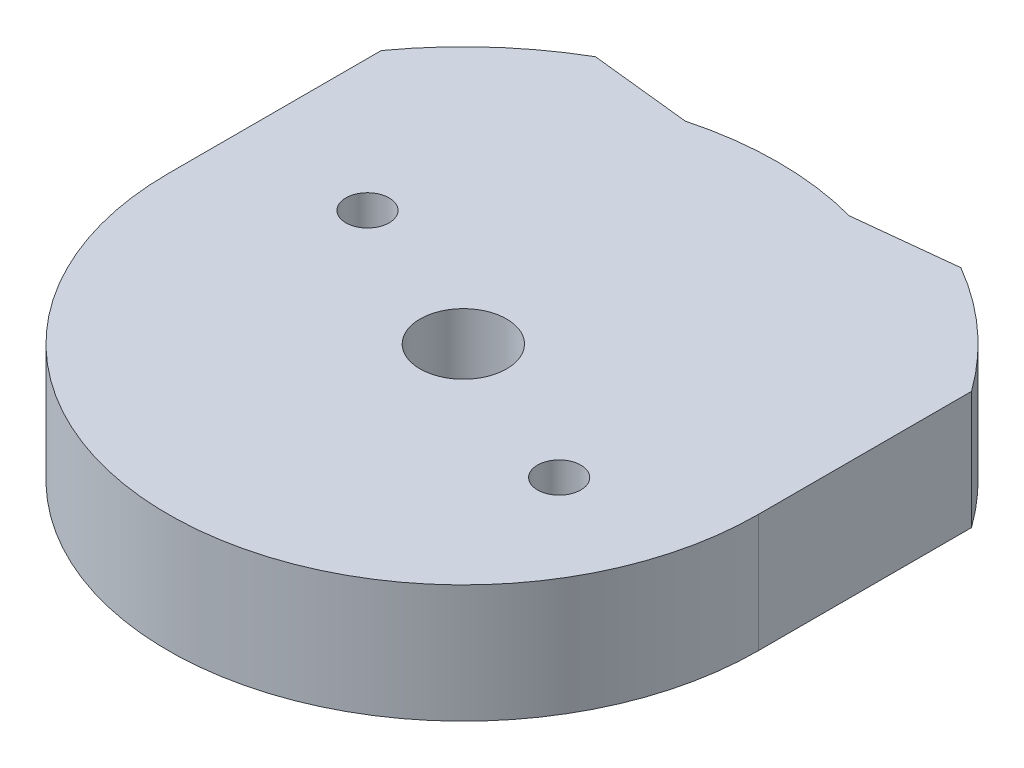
ISO-10303-21;
HEADER;
FILE_DESCRIPTION(('STEP AP214'),'2;1');
FILE_NAME('part.step','',(''),(''),'','','');
FILE_SCHEMA(('AUTOMOTIVE_DESIGN { 1 0 10303 214 1 1 1 1 }'));
ENDSEC;
DATA;
#1=APPLICATION_CONTEXT('core data for automotive mechanical design processes');
#2=APPLICATION_PROTOCOL_DEFINITION('international standard','automotive_design',2000,#1);
#3=PRODUCT_CONTEXT('',#1,'mechanical');
#4=PRODUCT('Part','Part','',(#3));
#5=PRODUCT_RELATED_PRODUCT_CATEGORY('part','',(#4));
#6=PRODUCT_DEFINITION_FORMATION('','',#4);
#7=PRODUCT_DEFINITION_CONTEXT('part definition',#1,'design');
#8=PRODUCT_DEFINITION('design','',#6,#7);
#9=PRODUCT_DEFINITION_SHAPE('','',#8);
#10=(LENGTH_UNIT() NAMED_UNIT(*) SI_UNIT(.MILLI.,.METRE.));
#11=(NAMED_UNIT(*) PLANE_ANGLE_UNIT() SI_UNIT($,.RADIAN.));
#12=(NAMED_UNIT(*) SI_UNIT($,.STERADIAN.) SOLID_ANGLE_UNIT());
#13=UNCERTAINTY_MEASURE_WITH_UNIT(LENGTH_MEASURE(1.E-05),#10,'distance_accuracy_value','');
#14=(GEOMETRIC_REPRESENTATION_CONTEXT(3) GLOBAL_UNCERTAINTY_ASSIGNED_CONTEXT((#13)) GLOBAL_UNIT_ASSIGNED_CONTEXT((#10,
#11,#12)) REPRESENTATION_CONTEXT('',''));
#15=CARTESIAN_POINT('',(0.,0.,0.));
#16=DIRECTION('',(0.,0.,1.));
#17=DIRECTION('',(1.,0.,0.));
#18=AXIS2_PLACEMENT_3D('',#15,#16,#17);
#19=CARTESIAN_POINT('',(0.,6.,0.));
#20=DIRECTION('',(0.,1.,0.));
#21=DIRECTION('',(0.,0.,1.));
#22=AXIS2_PLACEMENT_3D('',#19,#20,#21);
#23=PLANE('',#22);
#24=CARTESIAN_POINT('',(8.31491579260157,6.,3.44415089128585));
#25=DIRECTION('',(0.,1.,0.));
#26=DIRECTION('',(0.,0.,1.));
#27=AXIS2_PLACEMENT_3D('',#24,#25,#26);
#28=CIRCLE('',#27,1.1);
#29=CARTESIAN_POINT('',(8.31491579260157,6.,4.54415089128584));
#30=VERTEX_POINT('',#29);
#31=EDGE_CURVE('E166',#30,#30,#28,.T.);
#32=ORIENTED_EDGE('',*,*,#31,.F.);
#33=EDGE_LOOP('',(#32));
#34=FACE_BOUND('',#33,.T.);
#35=CARTESIAN_POINT('',(0.,6.,0.));
#36=DIRECTION('',(0.,1.,0.));
#37=DIRECTION('',(0.,0.,1.));
#38=AXIS2_PLACEMENT_3D('',#35,#36,#37);
#39=CIRCLE('',#38,15.);
#40=CARTESIAN_POINT('',(-15.,6.,0.));
#41=VERTEX_POINT('',#40);
#42=CARTESIAN_POINT('',(15.,6.,0.));
#43=VERTEX_POINT('',#42);
#44=EDGE_CURVE('E129',#41,#43,#39,.T.);
#45=ORIENTED_EDGE('',*,*,#44,.T.);
#46=DIRECTION('',(0.,0.,-1.));
#47=VECTOR('',#46,1.);
#48=CARTESIAN_POINT('',(15.,6.,0.));
#49=LINE('',#48,#47);
#50=CARTESIAN_POINT('',(15.,6.,-10.8282039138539));
#51=VERTEX_POINT('',#50);
#52=EDGE_CURVE('E77',#43,#51,#49,.T.);
#53=ORIENTED_EDGE('',*,*,#52,.T.);
#54=CARTESIAN_POINT('',(0.,6.,0.));
#55=DIRECTION('',(0.,1.,0.));
#56=DIRECTION('',(0.,0.,1.));
#57=AXIS2_PLACEMENT_3D('',#54,#55,#56);
#58=CIRCLE('',#57,18.5);
#59=CARTESIAN_POINT('',(9.28708781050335,6.,-16.));
#60=VERTEX_POINT('',#59);
#61=EDGE_CURVE('E144',#51,#60,#58,.T.);
#62=ORIENTED_EDGE('',*,*,#61,.T.);
#63=DIRECTION('',(-0.994252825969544,0.,0.107057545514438));
#64=VECTOR('',#63,1.);
#65=CARTESIAN_POINT('',(4.16478415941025,6.,-15.448448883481));
#66=LINE('',#65,#64);
#67=CARTESIAN_POINT('',(4.16478415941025,6.,-15.448448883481));
#68=VERTEX_POINT('',#67);
#69=EDGE_CURVE('E157',#60,#68,#66,.T.);
#70=ORIENTED_EDGE('',*,*,#69,.T.);
#71=CARTESIAN_POINT('',(0.,6.,0.));
#72=DIRECTION('',(0.,1.,0.));
#73=DIRECTION('',(0.,0.,1.));
#74=AXIS2_PLACEMENT_3D('',#71,#72,#73);
#75=CIRCLE('',#74,16.);
#76=CARTESIAN_POINT('',(-4.16478415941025,6.,-15.448448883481));
#77=VERTEX_POINT('',#76);
#78=EDGE_CURVE('E96',#68,#77,#75,.T.);
#79=ORIENTED_EDGE('',*,*,#78,.T.);
#80=DIRECTION('',(-0.994252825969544,0.,-0.107057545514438));
#81=VECTOR('',#80,1.);
#82=CARTESIAN_POINT('',(-9.28708781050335,6.,-16.));
#83=LINE('',#82,#81);
#84=CARTESIAN_POINT('',(-9.28708781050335,6.,-16.));
#85=VERTEX_POINT('',#84);
#86=EDGE_CURVE('E90',#77,#85,#83,.T.);
#87=ORIENTED_EDGE('',*,*,#86,.T.);
#88=CARTESIAN_POINT('',(0.,6.,0.));
#89=DIRECTION('',(0.,1.,0.));
#90=DIRECTION('',(0.,0.,1.));
#91=AXIS2_PLACEMENT_3D('',#88,#89,#90);
#92=CIRCLE('',#91,18.5);
#93=CARTESIAN_POINT('',(-15.,6.,-10.8282039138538));
#94=VERTEX_POINT('',#93);
#95=EDGE_CURVE('E94',#85,#94,#92,.T.);
#96=ORIENTED_EDGE('',*,*,#95,.T.);
#97=DIRECTION('',(0.,0.,1.));
#98=VECTOR('',#97,1.);
#99=CARTESIAN_POINT('',(-15.,6.,0.));
#100=LINE('',#99,#98);
#101=EDGE_CURVE('E34',#94,#41,#100,.T.);
#102=ORIENTED_EDGE('',*,*,#101,.T.);
#103=EDGE_LOOP('',(#45,#53,#62,#70,#79,#87,#96,#102));
#104=FACE_BOUND('',#103,.T.);
#105=CARTESIAN_POINT('',(0.,6.,0.));
#106=DIRECTION('',(0.,1.,0.));
#107=DIRECTION('',(0.,0.,1.));
#108=AXIS2_PLACEMENT_3D('',#105,#106,#107);
#109=CIRCLE('',#108,2.2);
#110=CARTESIAN_POINT('',(0.,6.,2.2));
#111=VERTEX_POINT('',#110);
#112=EDGE_CURVE('E118',#111,#111,#109,.T.);
#113=ORIENTED_EDGE('',*,*,#112,.F.);
#114=EDGE_LOOP('',(#113));
#115=FACE_BOUND('',#114,.T.);
#116=CARTESIAN_POINT('',(-8.31491579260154,6.,-3.4441508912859));
#117=DIRECTION('',(0.,1.,0.));
#118=DIRECTION('',(0.,0.,1.));
#119=AXIS2_PLACEMENT_3D('',#116,#117,#118);
#120=CIRCLE('',#119,1.1);
#121=CARTESIAN_POINT('',(-8.31491579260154,6.,-2.3441508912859));
#122=VERTEX_POINT('',#121);
#123=EDGE_CURVE('E172',#122,#122,#120,.T.);
#124=ORIENTED_EDGE('',*,*,#123,.F.);
#125=EDGE_LOOP('',(#124));
#126=FACE_BOUND('',#125,.T.);
#127=ADVANCED_FACE('F17',(#34,#104,#115,#126),#23,.T.);
#128=CARTESIAN_POINT('',(0.,0.,0.));
#129=DIRECTION('',(0.,1.,0.));
#130=DIRECTION('',(0.,0.,1.));
#131=AXIS2_PLACEMENT_3D('',#128,#129,#130);
#132=PLANE('',#131);
#133=CARTESIAN_POINT('',(8.31491579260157,0.,3.44415089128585));
#134=DIRECTION('',(0.,1.,0.));
#135=DIRECTION('',(0.,0.,1.));
#136=AXIS2_PLACEMENT_3D('',#133,#134,#135);
#137=CIRCLE('',#136,1.1);
#138=CARTESIAN_POINT('',(8.31491579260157,0.,4.54415089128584));
#139=VERTEX_POINT('',#138);
#140=EDGE_CURVE('E169',#139,#139,#137,.T.);
#141=ORIENTED_EDGE('',*,*,#140,.T.);
#142=EDGE_LOOP('',(#141));
#143=FACE_BOUND('',#142,.T.);
#144=CARTESIAN_POINT('',(0.,0.,0.));
#145=DIRECTION('',(0.,1.,0.));
#146=DIRECTION('',(0.,0.,1.));
#147=AXIS2_PLACEMENT_3D('',#144,#145,#146);
#148=CIRCLE('',#147,15.);
#149=CARTESIAN_POINT('',(-15.,0.,0.));
#150=VERTEX_POINT('',#149);
#151=CARTESIAN_POINT('',(15.,0.,0.));
#152=VERTEX_POINT('',#151);
#153=EDGE_CURVE('E114',#150,#152,#148,.T.);
#154=ORIENTED_EDGE('',*,*,#153,.F.);
#155=DIRECTION('',(0.,0.,1.));
#156=VECTOR('',#155,1.);
#157=CARTESIAN_POINT('',(-15.,0.,0.));
#158=LINE('',#157,#156);
#159=CARTESIAN_POINT('',(-15.,0.,-10.8282039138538));
#160=VERTEX_POINT('',#159);
#161=EDGE_CURVE('E69',#160,#150,#158,.T.);
#162=ORIENTED_EDGE('',*,*,#161,.F.);
#163=CARTESIAN_POINT('',(0.,0.,0.));
#164=DIRECTION('',(0.,1.,0.));
#165=DIRECTION('',(0.,0.,1.));
#166=AXIS2_PLACEMENT_3D('',#163,#164,#165);
#167=CIRCLE('',#166,18.5);
#168=CARTESIAN_POINT('',(-9.28708781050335,0.,-16.));
#169=VERTEX_POINT('',#168);
#170=EDGE_CURVE('E63',#169,#160,#167,.T.);
#171=ORIENTED_EDGE('',*,*,#170,.F.);
#172=DIRECTION('',(-0.994252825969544,0.,-0.107057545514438));
#173=VECTOR('',#172,1.);
#174=CARTESIAN_POINT('',(-9.28708781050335,0.,-16.));
#175=LINE('',#174,#173);
#176=CARTESIAN_POINT('',(-4.16478415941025,0.,-15.448448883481));
#177=VERTEX_POINT('',#176);
#178=EDGE_CURVE('E104',#177,#169,#175,.T.);
#179=ORIENTED_EDGE('',*,*,#178,.F.);
#180=CARTESIAN_POINT('',(0.,0.,0.));
#181=DIRECTION('',(0.,1.,0.));
#182=DIRECTION('',(0.,0.,1.));
#183=AXIS2_PLACEMENT_3D('',#180,#181,#182);
#184=CIRCLE('',#183,16.);
#185=CARTESIAN_POINT('',(4.16478415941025,0.,-15.448448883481));
#186=VERTEX_POINT('',#185);
#187=EDGE_CURVE('E124',#186,#177,#184,.T.);
#188=ORIENTED_EDGE('',*,*,#187,.F.);
#189=DIRECTION('',(-0.994252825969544,0.,0.107057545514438));
#190=VECTOR('',#189,1.);
#191=CARTESIAN_POINT('',(4.16478415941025,0.,-15.448448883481));
#192=LINE('',#191,#190);
#193=CARTESIAN_POINT('',(9.28708781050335,0.,-16.));
#194=VERTEX_POINT('',#193);
#195=EDGE_CURVE('E122',#194,#186,#192,.T.);
#196=ORIENTED_EDGE('',*,*,#195,.F.);
#197=CARTESIAN_POINT('',(0.,0.,0.));
#198=DIRECTION('',(0.,1.,0.));
#199=DIRECTION('',(0.,0.,1.));
#200=AXIS2_PLACEMENT_3D('',#197,#198,#199);
#201=CIRCLE('',#200,18.5);
#202=CARTESIAN_POINT('',(15.,0.,-10.8282039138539));
#203=VERTEX_POINT('',#202);
#204=EDGE_CURVE('E120',#203,#194,#201,.T.);
#205=ORIENTED_EDGE('',*,*,#204,.F.);
#206=DIRECTION('',(0.,0.,-1.));
#207=VECTOR('',#206,1.);
#208=CARTESIAN_POINT('',(15.,0.,0.));
#209=LINE('',#208,#207);
#210=EDGE_CURVE('E117',#152,#203,#209,.T.);
#211=ORIENTED_EDGE('',*,*,#210,.F.);
#212=EDGE_LOOP('',(#154,#162,#171,#179,#188,#196,#205,#211));
#213=FACE_BOUND('',#212,.T.);
#214=CARTESIAN_POINT('',(0.,0.,0.));
#215=DIRECTION('',(0.,1.,0.));
#216=DIRECTION('',(0.,0.,1.));
#217=AXIS2_PLACEMENT_3D('',#214,#215,#216);
#218=CIRCLE('',#217,2.2);
#219=CARTESIAN_POINT('',(0.,0.,2.2));
#220=VERTEX_POINT('',#219);
#221=EDGE_CURVE('E163',#220,#220,#218,.T.);
#222=ORIENTED_EDGE('',*,*,#221,.T.);
#223=EDGE_LOOP('',(#222));
#224=FACE_BOUND('',#223,.T.);
#225=CARTESIAN_POINT('',(-8.31491579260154,0.,-3.4441508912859));
#226=DIRECTION('',(0.,1.,0.));
#227=DIRECTION('',(0.,0.,1.));
#228=AXIS2_PLACEMENT_3D('',#225,#226,#227);
#229=CIRCLE('',#228,1.1);
#230=CARTESIAN_POINT('',(-8.31491579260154,0.,-2.3441508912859));
#231=VERTEX_POINT('',#230);
#232=EDGE_CURVE('E175',#231,#231,#229,.T.);
#233=ORIENTED_EDGE('',*,*,#232,.T.);
#234=EDGE_LOOP('',(#233));
#235=FACE_BOUND('',#234,.T.);
#236=ADVANCED_FACE('F148',(#143,#213,#224,#235),#132,.F.);
#237=CARTESIAN_POINT('',(0.,6.,0.));
#238=DIRECTION('',(0.,-1.,0.));
#239=DIRECTION('',(0.,0.,-1.));
#240=AXIS2_PLACEMENT_3D('',#237,#238,#239);
#241=CYLINDRICAL_SURFACE('',#240,15.);
#242=ORIENTED_EDGE('',*,*,#153,.T.);
#243=DIRECTION('',(0.,-1.,0.));
#244=VECTOR('',#243,1.);
#245=CARTESIAN_POINT('',(15.,6.,0.));
#246=LINE('',#245,#244);
#247=EDGE_CURVE('E11',#43,#152,#246,.T.);
#248=ORIENTED_EDGE('',*,*,#247,.F.);
#249=ORIENTED_EDGE('',*,*,#44,.F.);
#250=DIRECTION('',(0.,-1.,0.));
#251=VECTOR('',#250,1.);
#252=CARTESIAN_POINT('',(-15.,6.,0.));
#253=LINE('',#252,#251);
#254=EDGE_CURVE('E110',#41,#150,#253,.T.);
#255=ORIENTED_EDGE('',*,*,#254,.T.);
#256=EDGE_LOOP('',(#242,#248,#249,#255));
#257=FACE_BOUND('',#256,.T.);
#258=ADVANCED_FACE('F19',(#257),#241,.T.);
#259=CARTESIAN_POINT('',(15.,6.,0.));
#260=DIRECTION('',(-1.,0.,0.));
#261=DIRECTION('',(0.,0.,1.));
#262=AXIS2_PLACEMENT_3D('',#259,#260,#261);
#263=PLANE('',#262);
#264=ORIENTED_EDGE('',*,*,#210,.T.);
#265=DIRECTION('',(0.,-1.,0.));
#266=VECTOR('',#265,1.);
#267=CARTESIAN_POINT('',(15.,6.,-10.8282039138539));
#268=LINE('',#267,#266);
#269=EDGE_CURVE('E26',#51,#203,#268,.T.);
#270=ORIENTED_EDGE('',*,*,#269,.F.);
#271=ORIENTED_EDGE('',*,*,#52,.F.);
#272=ORIENTED_EDGE('',*,*,#247,.T.);
#273=EDGE_LOOP('',(#264,#270,#271,#272));
#274=FACE_BOUND('',#273,.T.);
#275=ADVANCED_FACE('F211',(#274),#263,.F.);
#276=CARTESIAN_POINT('',(0.,6.,0.));
#277=DIRECTION('',(0.,-1.,0.));
#278=DIRECTION('',(0.,0.,-1.));
#279=AXIS2_PLACEMENT_3D('',#276,#277,#278);
#280=CYLINDRICAL_SURFACE('',#279,18.5);
#281=ORIENTED_EDGE('',*,*,#204,.T.);
#282=DIRECTION('',(0.,-1.,0.));
#283=VECTOR('',#282,1.);
#284=CARTESIAN_POINT('',(9.28708781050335,6.,-16.));
#285=LINE('',#284,#283);
#286=EDGE_CURVE('E136',#60,#194,#285,.T.);
#287=ORIENTED_EDGE('',*,*,#286,.F.);
#288=ORIENTED_EDGE('',*,*,#61,.F.);
#289=ORIENTED_EDGE('',*,*,#269,.T.);
#290=EDGE_LOOP('',(#281,#287,#288,#289));
#291=FACE_BOUND('',#290,.T.);
#292=ADVANCED_FACE('F142',(#291),#280,.T.);
#293=CARTESIAN_POINT('',(4.16478415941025,6.,-15.448448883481));
#294=DIRECTION('',(0.107057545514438,0.,0.994252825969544));
#295=DIRECTION('',(0.994252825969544,0.,-0.107057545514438));
#296=AXIS2_PLACEMENT_3D('',#293,#294,#295);
#297=PLANE('',#296);
#298=ORIENTED_EDGE('',*,*,#195,.T.);
#299=DIRECTION('',(0.,-1.,0.));
#300=VECTOR('',#299,1.);
#301=CARTESIAN_POINT('',(4.16478415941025,6.,-15.448448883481));
#302=LINE('',#301,#300);
#303=EDGE_CURVE('E133',#68,#186,#302,.T.);
#304=ORIENTED_EDGE('',*,*,#303,.F.);
#305=ORIENTED_EDGE('',*,*,#69,.F.);
#306=ORIENTED_EDGE('',*,*,#286,.T.);
#307=EDGE_LOOP('',(#298,#304,#305,#306));
#308=FACE_BOUND('',#307,.T.);
#309=ADVANCED_FACE('F153',(#308),#297,.F.);
#310=CARTESIAN_POINT('',(0.,6.,0.));
#311=DIRECTION('',(0.,-1.,0.));
#312=DIRECTION('',(0.,0.,-1.));
#313=AXIS2_PLACEMENT_3D('',#310,#311,#312);
#314=CYLINDRICAL_SURFACE('',#313,16.);
#315=ORIENTED_EDGE('',*,*,#187,.T.);
#316=DIRECTION('',(0.,-1.,0.));
#317=VECTOR('',#316,1.);
#318=CARTESIAN_POINT('',(-4.16478415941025,6.,-15.448448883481));
#319=LINE('',#318,#317);
#320=EDGE_CURVE('E105',#77,#177,#319,.T.);
#321=ORIENTED_EDGE('',*,*,#320,.F.);
#322=ORIENTED_EDGE('',*,*,#78,.F.);
#323=ORIENTED_EDGE('',*,*,#303,.T.);
#324=EDGE_LOOP('',(#315,#321,#322,#323));
#325=FACE_BOUND('',#324,.T.);
#326=ADVANCED_FACE('F156',(#325),#314,.T.);
#327=CARTESIAN_POINT('',(-9.28708781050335,6.,-16.));
#328=DIRECTION('',(-0.107057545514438,0.,0.994252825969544));
#329=DIRECTION('',(0.994252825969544,0.,0.107057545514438));
#330=AXIS2_PLACEMENT_3D('',#327,#328,#329);
#331=PLANE('',#330);
#332=ORIENTED_EDGE('',*,*,#178,.T.);
#333=DIRECTION('',(0.,-1.,0.));
#334=VECTOR('',#333,1.);
#335=CARTESIAN_POINT('',(-9.28708781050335,6.,-16.));
#336=LINE('',#335,#334);
#337=EDGE_CURVE('E101',#85,#169,#336,.T.);
#338=ORIENTED_EDGE('',*,*,#337,.F.);
#339=ORIENTED_EDGE('',*,*,#86,.F.);
#340=ORIENTED_EDGE('',*,*,#320,.T.);
#341=EDGE_LOOP('',(#332,#338,#339,#340));
#342=FACE_BOUND('',#341,.T.);
#343=ADVANCED_FACE('F102',(#342),#331,.F.);
#344=CARTESIAN_POINT('',(0.,6.,0.));
#345=DIRECTION('',(0.,-1.,0.));
#346=DIRECTION('',(0.,0.,-1.));
#347=AXIS2_PLACEMENT_3D('',#344,#345,#346);
#348=CYLINDRICAL_SURFACE('',#347,18.5);
#349=ORIENTED_EDGE('',*,*,#170,.T.);
#350=DIRECTION('',(0.,-1.,0.));
#351=VECTOR('',#350,1.);
#352=CARTESIAN_POINT('',(-15.,6.,-10.8282039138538));
#353=LINE('',#352,#351);
#354=EDGE_CURVE('E106',#94,#160,#353,.T.);
#355=ORIENTED_EDGE('',*,*,#354,.F.);
#356=ORIENTED_EDGE('',*,*,#95,.F.);
#357=ORIENTED_EDGE('',*,*,#337,.T.);
#358=EDGE_LOOP('',(#349,#355,#356,#357));
#359=FACE_BOUND('',#358,.T.);
#360=ADVANCED_FACE('F108',(#359),#348,.T.);
#361=CARTESIAN_POINT('',(-15.,6.,0.));
#362=DIRECTION('',(1.,0.,0.));
#363=DIRECTION('',(0.,0.,-1.));
#364=AXIS2_PLACEMENT_3D('',#361,#362,#363);
#365=PLANE('',#364);
#366=ORIENTED_EDGE('',*,*,#161,.T.);
#367=ORIENTED_EDGE('',*,*,#254,.F.);
#368=ORIENTED_EDGE('',*,*,#101,.F.);
#369=ORIENTED_EDGE('',*,*,#354,.T.);
#370=EDGE_LOOP('',(#366,#367,#368,#369));
#371=FACE_BOUND('',#370,.T.);
#372=ADVANCED_FACE('F199',(#371),#365,.F.);
#373=CARTESIAN_POINT('',(0.,6.,0.));
#374=DIRECTION('',(0.,-1.,0.));
#375=DIRECTION('',(0.,0.,-1.));
#376=AXIS2_PLACEMENT_3D('',#373,#374,#375);
#377=CYLINDRICAL_SURFACE('',#376,2.2);
#378=ORIENTED_EDGE('',*,*,#112,.T.);
#379=EDGE_LOOP('',(#378));
#380=FACE_BOUND('',#379,.T.);
#381=ORIENTED_EDGE('',*,*,#221,.F.);
#382=EDGE_LOOP('',(#381));
#383=FACE_BOUND('',#382,.T.);
#384=ADVANCED_FACE('F196',(#380,#383),#377,.F.);
#385=CARTESIAN_POINT('',(8.31491579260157,6.,3.44415089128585));
#386=DIRECTION('',(0.,-1.,0.));
#387=DIRECTION('',(0.,0.,-1.));
#388=AXIS2_PLACEMENT_3D('',#385,#386,#387);
#389=CYLINDRICAL_SURFACE('',#388,1.1);
#390=ORIENTED_EDGE('',*,*,#31,.T.);
#391=EDGE_LOOP('',(#390));
#392=FACE_BOUND('',#391,.T.);
#393=ORIENTED_EDGE('',*,*,#140,.F.);
#394=EDGE_LOOP('',(#393));
#395=FACE_BOUND('',#394,.T.);
#396=ADVANCED_FACE('F274',(#392,#395),#389,.F.);
#397=CARTESIAN_POINT('',(-8.31491579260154,6.,-3.4441508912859));
#398=DIRECTION('',(0.,-1.,0.));
#399=DIRECTION('',(0.,0.,-1.));
#400=AXIS2_PLACEMENT_3D('',#397,#398,#399);
#401=CYLINDRICAL_SURFACE('',#400,1.1);
#402=ORIENTED_EDGE('',*,*,#123,.T.);
#403=EDGE_LOOP('',(#402));
#404=FACE_BOUND('',#403,.T.);
#405=ORIENTED_EDGE('',*,*,#232,.F.);
#406=EDGE_LOOP('',(#405));
#407=FACE_BOUND('',#406,.T.);
#408=ADVANCED_FACE('F181',(#404,#407),#401,.F.);
#409=CLOSED_SHELL('',(#127,#236,#258,#275,#292,#309,#326,#343,#360,#372,#384,#396,#408));
#410=MANIFOLD_SOLID_BREP('B1',#409);
#411=ADVANCED_BREP_SHAPE_REPRESENTATION('',(#18,#410),#14);
#412=SHAPE_DEFINITION_REPRESENTATION(#9,#411);
ENDSEC;
END-ISO-10303-21;
